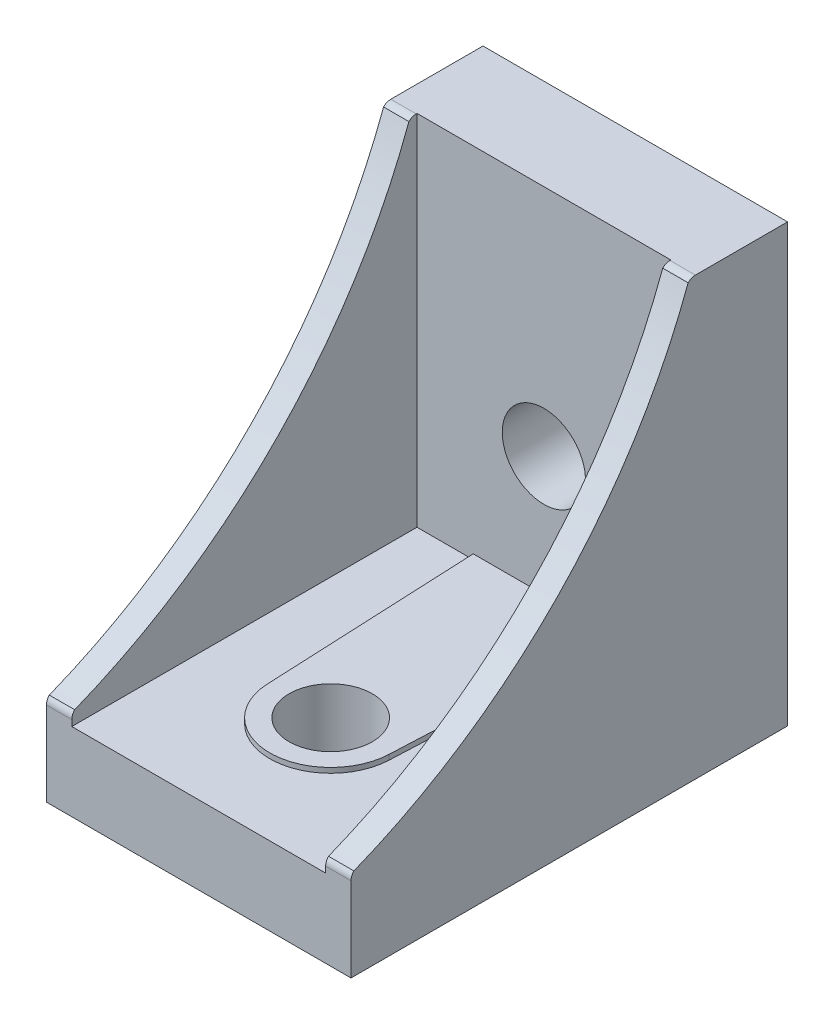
ISO-10303-21;
HEADER;
FILE_DESCRIPTION(('STEP AP214'),'2;1');
FILE_NAME('part.step','',(''),(''),'','','');
FILE_SCHEMA(('AUTOMOTIVE_DESIGN { 1 0 10303 214 1 1 1 1 }'));
ENDSEC;
DATA;
#1=APPLICATION_CONTEXT('core data for automotive mechanical design processes');
#2=APPLICATION_PROTOCOL_DEFINITION('international standard','automotive_design',2000,#1);
#3=PRODUCT_CONTEXT('',#1,'mechanical');
#4=PRODUCT('Part','Part','',(#3));
#5=PRODUCT_RELATED_PRODUCT_CATEGORY('part','',(#4));
#6=PRODUCT_DEFINITION_FORMATION('','',#4);
#7=PRODUCT_DEFINITION_CONTEXT('part definition',#1,'design');
#8=PRODUCT_DEFINITION('design','',#6,#7);
#9=PRODUCT_DEFINITION_SHAPE('','',#8);
#10=(LENGTH_UNIT() NAMED_UNIT(*) SI_UNIT(.MILLI.,.METRE.));
#11=(NAMED_UNIT(*) PLANE_ANGLE_UNIT() SI_UNIT($,.RADIAN.));
#12=(NAMED_UNIT(*) SI_UNIT($,.STERADIAN.) SOLID_ANGLE_UNIT());
#13=UNCERTAINTY_MEASURE_WITH_UNIT(LENGTH_MEASURE(1.E-05),#10,'distance_accuracy_value','');
#14=(GEOMETRIC_REPRESENTATION_CONTEXT(3) GLOBAL_UNCERTAINTY_ASSIGNED_CONTEXT((#13)) GLOBAL_UNIT_ASSIGNED_CONTEXT((#10,
#11,#12)) REPRESENTATION_CONTEXT('',''));
#15=CARTESIAN_POINT('',(0.,0.,0.));
#16=DIRECTION('',(0.,0.,1.));
#17=DIRECTION('',(1.,0.,0.));
#18=AXIS2_PLACEMENT_3D('',#15,#16,#17);
#19=CARTESIAN_POINT('',(-12.5,7.7,52.));
#20=DIRECTION('',(0.,-1.,0.));
#21=DIRECTION('',(0.,0.,-1.));
#22=AXIS2_PLACEMENT_3D('',#19,#20,#21);
#23=PLANE('',#22);
#24=DIRECTION('',(0.0454953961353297,0.,0.998964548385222));
#25=VECTOR('',#24,1.);
#26=CARTESIAN_POINT('',(-5.01979784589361,7.7,51.6593324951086));
#27=LINE('',#26,#25);
#28=CARTESIAN_POINT('',(-6.96261276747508,7.7,9.));
#29=VERTEX_POINT('',#28);
#30=CARTESIAN_POINT('',(-5.99378729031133,7.7,30.272972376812));
#31=VERTEX_POINT('',#30);
#32=EDGE_CURVE('E405',#29,#31,#27,.T.);
#33=ORIENTED_EDGE('',*,*,#32,.F.);
#34=DIRECTION('',(1.,0.,0.));
#35=VECTOR('',#34,1.);
#36=CARTESIAN_POINT('',(-12.5,7.7,9.));
#37=LINE('',#36,#35);
#38=CARTESIAN_POINT('',(-12.5,7.7,9.));
#39=VERTEX_POINT('',#38);
#40=EDGE_CURVE('E426',#39,#29,#37,.T.);
#41=ORIENTED_EDGE('',*,*,#40,.F.);
#42=DIRECTION('',(0.,0.,-1.));
#43=VECTOR('',#42,1.);
#44=CARTESIAN_POINT('',(-12.5,7.7,52.));
#45=LINE('',#44,#43);
#46=CARTESIAN_POINT('',(-12.5,7.7,43.));
#47=VERTEX_POINT('',#46);
#48=EDGE_CURVE('E420',#47,#39,#45,.T.);
#49=ORIENTED_EDGE('',*,*,#48,.F.);
#50=DIRECTION('',(-1.,0.,0.));
#51=VECTOR('',#50,1.);
#52=CARTESIAN_POINT('',(15.,7.7,43.));
#53=LINE('',#52,#51);
#54=CARTESIAN_POINT('',(12.5,7.7,43.));
#55=VERTEX_POINT('',#54);
#56=EDGE_CURVE('E497',#55,#47,#53,.T.);
#57=ORIENTED_EDGE('',*,*,#56,.F.);
#58=DIRECTION('',(0.,0.,-1.));
#59=VECTOR('',#58,1.);
#60=CARTESIAN_POINT('',(12.5,7.7,52.));
#61=LINE('',#60,#59);
#62=CARTESIAN_POINT('',(12.5,7.7,9.));
#63=VERTEX_POINT('',#62);
#64=EDGE_CURVE('E414',#55,#63,#61,.T.);
#65=ORIENTED_EDGE('',*,*,#64,.T.);
#66=CARTESIAN_POINT('',(6.96261276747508,7.7,9.));
#67=VERTEX_POINT('',#66);
#68=EDGE_CURVE('E425',#67,#63,#37,.T.);
#69=ORIENTED_EDGE('',*,*,#68,.F.);
#70=DIRECTION('',(0.0454953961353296,0.,-0.998964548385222));
#71=VECTOR('',#70,1.);
#72=CARTESIAN_POINT('',(4.96805206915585,7.7,52.795539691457));
#73=LINE('',#72,#71);
#74=CARTESIAN_POINT('',(5.99378729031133,7.7,30.272972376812));
#75=VERTEX_POINT('',#74);
#76=EDGE_CURVE('E403',#75,#67,#73,.T.);
#77=ORIENTED_EDGE('',*,*,#76,.F.);
#78=CARTESIAN_POINT('',(0.,7.7,30.));
#79=DIRECTION('',(0.,-1.,0.));
#80=DIRECTION('',(0.,0.,-1.));
#81=AXIS2_PLACEMENT_3D('',#78,#79,#80);
#82=CIRCLE('',#81,6.);
#83=EDGE_CURVE('E11',#31,#75,#82,.F.);
#84=ORIENTED_EDGE('',*,*,#83,.F.);
#85=EDGE_LOOP('',(#33,#41,#49,#57,#65,#69,#77,#84));
#86=FACE_BOUND('',#85,.T.);
#87=ADVANCED_FACE('F16',(#86),#23,.F.);
#88=CARTESIAN_POINT('',(-12.5,7.7,9.));
#89=DIRECTION('',(0.,0.,-1.));
#90=DIRECTION('',(-1.,0.,0.));
#91=AXIS2_PLACEMENT_3D('',#88,#89,#90);
#92=PLANE('',#91);
#93=CARTESIAN_POINT('',(0.,20.,9.));
#94=DIRECTION('',(0.,0.,-1.));
#95=DIRECTION('',(-1.,0.,0.));
#96=AXIS2_PLACEMENT_3D('',#93,#94,#95);
#97=CIRCLE('',#96,4.1);
#98=CARTESIAN_POINT('',(-4.1,20.,9.));
#99=VERTEX_POINT('',#98);
#100=EDGE_CURVE('E388',#99,#99,#97,.F.);
#101=ORIENTED_EDGE('',*,*,#100,.F.);
#102=EDGE_LOOP('',(#101));
#103=FACE_BOUND('',#102,.T.);
#104=DIRECTION('',(0.,-1.,0.));
#105=VECTOR('',#104,1.);
#106=CARTESIAN_POINT('',(-6.96261276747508,7.7,9.));
#107=LINE('',#106,#105);
#108=CARTESIAN_POINT('',(-6.96261276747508,8.2,9.));
#109=VERTEX_POINT('',#108);
#110=EDGE_CURVE('E25',#109,#29,#107,.T.);
#111=ORIENTED_EDGE('',*,*,#110,.F.);
#112=DIRECTION('',(1.,0.,0.));
#113=VECTOR('',#112,1.);
#114=CARTESIAN_POINT('',(-12.5,8.2,9.));
#115=LINE('',#114,#113);
#116=CARTESIAN_POINT('',(6.96261276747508,8.2,9.));
#117=VERTEX_POINT('',#116);
#118=EDGE_CURVE('E503',#109,#117,#115,.T.);
#119=ORIENTED_EDGE('',*,*,#118,.T.);
#120=DIRECTION('',(0.,1.,0.));
#121=VECTOR('',#120,1.);
#122=CARTESIAN_POINT('',(6.96261276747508,7.7,9.));
#123=LINE('',#122,#121);
#124=EDGE_CURVE('E506',#67,#117,#123,.T.);
#125=ORIENTED_EDGE('',*,*,#124,.F.);
#126=ORIENTED_EDGE('',*,*,#68,.T.);
#127=DIRECTION('',(0.,1.,0.));
#128=VECTOR('',#127,1.);
#129=CARTESIAN_POINT('',(12.5,7.7,9.));
#130=LINE('',#129,#128);
#131=CARTESIAN_POINT('',(12.5,43.,9.));
#132=VERTEX_POINT('',#131);
#133=EDGE_CURVE('E417',#63,#132,#130,.T.);
#134=ORIENTED_EDGE('',*,*,#133,.T.);
#135=DIRECTION('',(1.,0.,0.));
#136=VECTOR('',#135,1.);
#137=CARTESIAN_POINT('',(15.,43.,9.));
#138=LINE('',#137,#136);
#139=CARTESIAN_POINT('',(-12.5,43.,9.));
#140=VERTEX_POINT('',#139);
#141=EDGE_CURVE('E494',#140,#132,#138,.T.);
#142=ORIENTED_EDGE('',*,*,#141,.F.);
#143=DIRECTION('',(0.,1.,0.));
#144=VECTOR('',#143,1.);
#145=CARTESIAN_POINT('',(-12.5,7.7,9.));
#146=LINE('',#145,#144);
#147=EDGE_CURVE('E422',#39,#140,#146,.T.);
#148=ORIENTED_EDGE('',*,*,#147,.F.);
#149=ORIENTED_EDGE('',*,*,#40,.T.);
#150=EDGE_LOOP('',(#111,#119,#125,#126,#134,#142,#148,#149));
#151=FACE_BOUND('',#150,.T.);
#152=ADVANCED_FACE('F522',(#103,#151),#92,.F.);
#153=CARTESIAN_POINT('',(15.,8.29268128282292,43.));
#154=DIRECTION('',(0.,0.,-1.));
#155=DIRECTION('',(-1.,0.,0.));
#156=AXIS2_PLACEMENT_3D('',#153,#154,#155);
#157=PLANE('',#156);
#158=DIRECTION('',(0.,-1.,0.));
#159=VECTOR('',#158,1.);
#160=CARTESIAN_POINT('',(-15.,8.29268128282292,43.));
#161=LINE('',#160,#159);
#162=CARTESIAN_POINT('',(-15.,8.29268128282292,43.));
#163=VERTEX_POINT('',#162);
#164=CARTESIAN_POINT('',(-15.,0.,43.));
#165=VERTEX_POINT('',#164);
#166=EDGE_CURVE('E445',#163,#165,#161,.T.);
#167=ORIENTED_EDGE('',*,*,#166,.T.);
#168=DIRECTION('',(1.,0.,0.));
#169=VECTOR('',#168,1.);
#170=CARTESIAN_POINT('',(-15.,0.,43.));
#171=LINE('',#170,#169);
#172=CARTESIAN_POINT('',(15.,0.,43.));
#173=VERTEX_POINT('',#172);
#174=EDGE_CURVE('E32',#165,#173,#171,.T.);
#175=ORIENTED_EDGE('',*,*,#174,.T.);
#176=DIRECTION('',(0.,-1.,0.));
#177=VECTOR('',#176,1.);
#178=CARTESIAN_POINT('',(15.,8.29268128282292,43.));
#179=LINE('',#178,#177);
#180=CARTESIAN_POINT('',(15.,8.29268128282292,43.));
#181=VERTEX_POINT('',#180);
#182=EDGE_CURVE('E459',#181,#173,#179,.T.);
#183=ORIENTED_EDGE('',*,*,#182,.F.);
#184=DIRECTION('',(-1.,0.,0.));
#185=VECTOR('',#184,1.);
#186=CARTESIAN_POINT('',(15.,8.29268128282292,43.));
#187=LINE('',#186,#185);
#188=CARTESIAN_POINT('',(12.5,8.29268128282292,43.));
#189=VERTEX_POINT('',#188);
#190=EDGE_CURVE('E472',#181,#189,#187,.T.);
#191=ORIENTED_EDGE('',*,*,#190,.T.);
#192=DIRECTION('',(0.,-1.,0.));
#193=VECTOR('',#192,1.);
#194=CARTESIAN_POINT('',(12.5,8.29268128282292,43.));
#195=LINE('',#194,#193);
#196=EDGE_CURVE('E435',#189,#55,#195,.T.);
#197=ORIENTED_EDGE('',*,*,#196,.T.);
#198=ORIENTED_EDGE('',*,*,#56,.T.);
#199=DIRECTION('',(0.,-1.,0.));
#200=VECTOR('',#199,1.);
#201=CARTESIAN_POINT('',(-12.5,8.29268128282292,43.));
#202=LINE('',#201,#200);
#203=CARTESIAN_POINT('',(-12.5,8.29268128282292,43.));
#204=VERTEX_POINT('',#203);
#205=EDGE_CURVE('E443',#204,#47,#202,.T.);
#206=ORIENTED_EDGE('',*,*,#205,.F.);
#207=EDGE_CURVE('E471',#204,#163,#187,.T.);
#208=ORIENTED_EDGE('',*,*,#207,.T.);
#209=EDGE_LOOP('',(#167,#175,#183,#191,#197,#198,#206,#208));
#210=FACE_BOUND('',#209,.T.);
#211=ADVANCED_FACE('F18',(#210),#157,.F.);
#212=CARTESIAN_POINT('',(15.,43.,0.));
#213=DIRECTION('',(0.,-1.,0.));
#214=DIRECTION('',(0.,0.,-1.));
#215=AXIS2_PLACEMENT_3D('',#212,#213,#214);
#216=PLANE('',#215);
#217=DIRECTION('',(0.,0.,1.));
#218=VECTOR('',#217,1.);
#219=CARTESIAN_POINT('',(-12.5,43.,0.));
#220=LINE('',#219,#218);
#221=CARTESIAN_POINT('',(-12.5,43.,9.07885781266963));
#222=VERTEX_POINT('',#221);
#223=EDGE_CURVE('E441',#140,#222,#220,.T.);
#224=ORIENTED_EDGE('',*,*,#223,.F.);
#225=ORIENTED_EDGE('',*,*,#141,.T.);
#226=DIRECTION('',(0.,0.,1.));
#227=VECTOR('',#226,1.);
#228=CARTESIAN_POINT('',(12.5,43.,0.));
#229=LINE('',#228,#227);
#230=CARTESIAN_POINT('',(12.5,43.,9.07885781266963));
#231=VERTEX_POINT('',#230);
#232=EDGE_CURVE('E432',#132,#231,#229,.T.);
#233=ORIENTED_EDGE('',*,*,#232,.T.);
#234=DIRECTION('',(-1.,0.,0.));
#235=VECTOR('',#234,1.);
#236=CARTESIAN_POINT('',(15.,43.,9.07885781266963));
#237=LINE('',#236,#235);
#238=CARTESIAN_POINT('',(15.,43.,9.07885781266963));
#239=VERTEX_POINT('',#238);
#240=EDGE_CURVE('E483',#239,#231,#237,.T.);
#241=ORIENTED_EDGE('',*,*,#240,.F.);
#242=DIRECTION('',(0.,0.,1.));
#243=VECTOR('',#242,1.);
#244=CARTESIAN_POINT('',(15.,43.,0.));
#245=LINE('',#244,#243);
#246=CARTESIAN_POINT('',(15.,43.,0.));
#247=VERTEX_POINT('',#246);
#248=EDGE_CURVE('E464',#247,#239,#245,.T.);
#249=ORIENTED_EDGE('',*,*,#248,.F.);
#250=DIRECTION('',(-1.,0.,0.));
#251=VECTOR('',#250,1.);
#252=CARTESIAN_POINT('',(15.,43.,0.));
#253=LINE('',#252,#251);
#254=CARTESIAN_POINT('',(-15.,43.,0.));
#255=VERTEX_POINT('',#254);
#256=EDGE_CURVE('E486',#247,#255,#253,.T.);
#257=ORIENTED_EDGE('',*,*,#256,.T.);
#258=DIRECTION('',(0.,0.,1.));
#259=VECTOR('',#258,1.);
#260=CARTESIAN_POINT('',(-15.,43.,0.));
#261=LINE('',#260,#259);
#262=CARTESIAN_POINT('',(-15.,43.,9.07885781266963));
#263=VERTEX_POINT('',#262);
#264=EDGE_CURVE('E450',#255,#263,#261,.T.);
#265=ORIENTED_EDGE('',*,*,#264,.T.);
#266=EDGE_CURVE('E482',#222,#263,#237,.T.);
#267=ORIENTED_EDGE('',*,*,#266,.F.);
#268=EDGE_LOOP('',(#224,#225,#233,#241,#249,#257,#265,#267));
#269=FACE_BOUND('',#268,.T.);
#270=ADVANCED_FACE('F530',(#269),#216,.F.);
#271=CARTESIAN_POINT('',(15.,42.,9.07885781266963));
#272=DIRECTION('',(-1.,0.,0.));
#273=DIRECTION('',(0.,0.,1.));
#274=AXIS2_PLACEMENT_3D('',#271,#272,#273);
#275=CYLINDRICAL_SURFACE('',#274,0.99999999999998);
#276=CARTESIAN_POINT('',(-12.5,42.,9.07885781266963));
#277=DIRECTION('',(1.,0.,0.));
#278=DIRECTION('',(0.,0.,-1.));
#279=AXIS2_PLACEMENT_3D('',#276,#277,#278);
#280=CIRCLE('',#279,0.99999999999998);
#281=CARTESIAN_POINT('',(-12.5,42.6987147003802,9.79425823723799));
#282=VERTEX_POINT('',#281);
#283=EDGE_CURVE('E438',#222,#282,#280,.T.);
#284=ORIENTED_EDGE('',*,*,#283,.F.);
#285=ORIENTED_EDGE('',*,*,#266,.T.);
#286=CARTESIAN_POINT('',(-15.,42.,9.07885781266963));
#287=DIRECTION('',(1.,0.,0.));
#288=DIRECTION('',(0.,0.,-1.));
#289=AXIS2_PLACEMENT_3D('',#286,#287,#288);
#290=CIRCLE('',#289,0.99999999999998);
#291=CARTESIAN_POINT('',(-15.,42.6987147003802,9.79425823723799));
#292=VERTEX_POINT('',#291);
#293=EDGE_CURVE('E453',#263,#292,#290,.T.);
#294=ORIENTED_EDGE('',*,*,#293,.T.);
#295=DIRECTION('',(-1.,0.,0.));
#296=VECTOR('',#295,1.);
#297=CARTESIAN_POINT('',(15.,42.6987147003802,9.794258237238));
#298=LINE('',#297,#296);
#299=EDGE_CURVE('E479',#282,#292,#298,.T.);
#300=ORIENTED_EDGE('',*,*,#299,.F.);
#301=EDGE_LOOP('',(#284,#285,#294,#300));
#302=FACE_BOUND('',#301,.T.);
#303=ADVANCED_FACE('F534',(#302),#275,.T.);
#304=CARTESIAN_POINT('',(15.,8.29268128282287,42.));
#305=DIRECTION('',(-1.,0.,0.));
#306=DIRECTION('',(0.,0.,1.));
#307=AXIS2_PLACEMENT_3D('',#304,#305,#306);
#308=CYLINDRICAL_SURFACE('',#307,1.00000000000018);
#309=CARTESIAN_POINT('',(-12.5,8.29268128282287,42.));
#310=DIRECTION('',(1.,0.,0.));
#311=DIRECTION('',(0.,0.,-1.));
#312=AXIS2_PLACEMENT_3D('',#309,#310,#311);
#313=CIRCLE('',#312,1.00000000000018);
#314=CARTESIAN_POINT('',(-12.5,8.99139598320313,42.7154004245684));
#315=VERTEX_POINT('',#314);
#316=EDGE_CURVE('E492',#315,#204,#313,.T.);
#317=ORIENTED_EDGE('',*,*,#316,.F.);
#318=DIRECTION('',(-1.,0.,0.));
#319=VECTOR('',#318,1.);
#320=CARTESIAN_POINT('',(15.,8.99139598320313,42.7154004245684));
#321=LINE('',#320,#319);
#322=CARTESIAN_POINT('',(-15.,8.99139598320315,42.7154004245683));
#323=VERTEX_POINT('',#322);
#324=EDGE_CURVE('E475',#315,#323,#321,.T.);
#325=ORIENTED_EDGE('',*,*,#324,.T.);
#326=CARTESIAN_POINT('',(-15.,8.29268128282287,42.));
#327=DIRECTION('',(1.,0.,0.));
#328=DIRECTION('',(0.,0.,-1.));
#329=AXIS2_PLACEMENT_3D('',#326,#327,#328);
#330=CIRCLE('',#329,1.00000000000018);
#331=EDGE_CURVE('E456',#323,#163,#330,.T.);
#332=ORIENTED_EDGE('',*,*,#331,.T.);
#333=ORIENTED_EDGE('',*,*,#207,.F.);
#334=EDGE_LOOP('',(#317,#325,#332,#333));
#335=FACE_BOUND('',#334,.T.);
#336=ADVANCED_FACE('F546',(#335),#308,.T.);
#337=CARTESIAN_POINT('',(15.,0.,0.));
#338=DIRECTION('',(0.,0.,1.));
#339=DIRECTION('',(1.,0.,0.));
#340=AXIS2_PLACEMENT_3D('',#337,#338,#339);
#341=PLANE('',#340);
#342=CARTESIAN_POINT('',(0.,20.,0.));
#343=DIRECTION('',(0.,0.,1.));
#344=DIRECTION('',(1.,0.,0.));
#345=AXIS2_PLACEMENT_3D('',#342,#343,#344);
#346=CIRCLE('',#345,4.1);
#347=CARTESIAN_POINT('',(4.1,20.,0.));
#348=VERTEX_POINT('',#347);
#349=EDGE_CURVE('E20',#348,#348,#346,.F.);
#350=ORIENTED_EDGE('',*,*,#349,.F.);
#351=EDGE_LOOP('',(#350));
#352=FACE_BOUND('',#351,.T.);
#353=DIRECTION('',(0.,1.,0.));
#354=VECTOR('',#353,1.);
#355=CARTESIAN_POINT('',(15.,0.,0.));
#356=LINE('',#355,#354);
#357=CARTESIAN_POINT('',(15.,0.,0.));
#358=VERTEX_POINT('',#357);
#359=EDGE_CURVE('E462',#358,#247,#356,.T.);
#360=ORIENTED_EDGE('',*,*,#359,.F.);
#361=DIRECTION('',(-1.,0.,0.));
#362=VECTOR('',#361,1.);
#363=CARTESIAN_POINT('',(15.,0.,0.));
#364=LINE('',#363,#362);
#365=CARTESIAN_POINT('',(-15.,0.,0.));
#366=VERTEX_POINT('',#365);
#367=EDGE_CURVE('E360',#358,#366,#364,.T.);
#368=ORIENTED_EDGE('',*,*,#367,.T.);
#369=DIRECTION('',(0.,1.,0.));
#370=VECTOR('',#369,1.);
#371=CARTESIAN_POINT('',(-15.,0.,0.));
#372=LINE('',#371,#370);
#373=EDGE_CURVE('E448',#366,#255,#372,.T.);
#374=ORIENTED_EDGE('',*,*,#373,.T.);
#375=ORIENTED_EDGE('',*,*,#256,.F.);
#376=EDGE_LOOP('',(#360,#368,#374,#375));
#377=FACE_BOUND('',#376,.T.);
#378=ADVANCED_FACE('F604',(#352,#377),#341,.F.);
#379=ORIENTED_EDGE('',*,*,#240,.T.);
#380=CARTESIAN_POINT('',(12.5,42.,9.07885781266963));
#381=DIRECTION('',(1.,0.,0.));
#382=DIRECTION('',(0.,0.,-1.));
#383=AXIS2_PLACEMENT_3D('',#380,#381,#382);
#384=CIRCLE('',#383,0.99999999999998);
#385=CARTESIAN_POINT('',(12.5,42.6987147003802,9.794258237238));
#386=VERTEX_POINT('',#385);
#387=EDGE_CURVE('E429',#231,#386,#384,.T.);
#388=ORIENTED_EDGE('',*,*,#387,.T.);
#389=CARTESIAN_POINT('',(15.,42.6987147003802,9.79425823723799));
#390=VERTEX_POINT('',#389);
#391=EDGE_CURVE('E480',#390,#386,#298,.T.);
#392=ORIENTED_EDGE('',*,*,#391,.F.);
#393=CARTESIAN_POINT('',(15.,42.,9.07885781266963));
#394=DIRECTION('',(1.,0.,0.));
#395=DIRECTION('',(0.,0.,-1.));
#396=AXIS2_PLACEMENT_3D('',#393,#394,#395);
#397=CIRCLE('',#396,0.99999999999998);
#398=EDGE_CURVE('E466',#239,#390,#397,.T.);
#399=ORIENTED_EDGE('',*,*,#398,.F.);
#400=EDGE_LOOP('',(#379,#388,#392,#399));
#401=FACE_BOUND('',#400,.T.);
#402=ADVANCED_FACE('F600',(#401),#275,.T.);
#403=CARTESIAN_POINT('',(15.,8.99139598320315,42.7154004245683));
#404=VERTEX_POINT('',#403);
#405=CARTESIAN_POINT('',(12.5,8.99139598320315,42.7154004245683));
#406=VERTEX_POINT('',#405);
#407=EDGE_CURVE('E476',#404,#406,#321,.T.);
#408=ORIENTED_EDGE('',*,*,#407,.T.);
#409=CARTESIAN_POINT('',(12.5,8.29268128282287,42.));
#410=DIRECTION('',(1.,0.,0.));
#411=DIRECTION('',(0.,0.,-1.));
#412=AXIS2_PLACEMENT_3D('',#409,#410,#411);
#413=CIRCLE('',#412,1.00000000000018);
#414=EDGE_CURVE('E489',#406,#189,#413,.T.);
#415=ORIENTED_EDGE('',*,*,#414,.T.);
#416=ORIENTED_EDGE('',*,*,#190,.F.);
#417=CARTESIAN_POINT('',(15.,8.29268128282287,42.));
#418=DIRECTION('',(1.,0.,0.));
#419=DIRECTION('',(0.,0.,-1.));
#420=AXIS2_PLACEMENT_3D('',#417,#418,#419);
#421=CIRCLE('',#420,1.00000000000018);
#422=EDGE_CURVE('E469',#404,#181,#421,.T.);
#423=ORIENTED_EDGE('',*,*,#422,.F.);
#424=EDGE_LOOP('',(#408,#415,#416,#423));
#425=FACE_BOUND('',#424,.T.);
#426=ADVANCED_FACE('F596',(#425),#308,.T.);
#427=CARTESIAN_POINT('',(15.,42.,9.07885781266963));
#428=DIRECTION('',(1.,0.,0.));
#429=DIRECTION('',(0.,0.,-1.));
#430=AXIS2_PLACEMENT_3D('',#427,#428,#429);
#431=PLANE('',#430);
#432=DIRECTION('',(0.,0.,-1.));
#433=VECTOR('',#432,1.);
#434=CARTESIAN_POINT('',(15.,0.,43.));
#435=LINE('',#434,#433);
#436=EDGE_CURVE('E379',#173,#358,#435,.T.);
#437=ORIENTED_EDGE('',*,*,#436,.T.);
#438=ORIENTED_EDGE('',*,*,#359,.T.);
#439=ORIENTED_EDGE('',*,*,#248,.T.);
#440=ORIENTED_EDGE('',*,*,#398,.T.);
#441=CARTESIAN_POINT('',(15.,62.8766713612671,64.1707824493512));
#442=DIRECTION('',(1.,0.,0.));
#443=DIRECTION('',(0.,0.,-1.));
#444=AXIS2_PLACEMENT_3D('',#441,#442,#443);
#445=CIRCLE('',#444,57.9996234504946);
#446=EDGE_CURVE('E407',#404,#390,#445,.T.);
#447=ORIENTED_EDGE('',*,*,#446,.F.);
#448=ORIENTED_EDGE('',*,*,#422,.T.);
#449=ORIENTED_EDGE('',*,*,#182,.T.);
#450=EDGE_LOOP('',(#437,#438,#439,#440,#447,#448,#449));
#451=FACE_BOUND('',#450,.T.);
#452=ADVANCED_FACE('F593',(#451),#431,.T.);
#453=CARTESIAN_POINT('',(-15.,42.,9.07885781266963));
#454=DIRECTION('',(1.,0.,0.));
#455=DIRECTION('',(0.,0.,-1.));
#456=AXIS2_PLACEMENT_3D('',#453,#454,#455);
#457=PLANE('',#456);
#458=ORIENTED_EDGE('',*,*,#373,.F.);
#459=DIRECTION('',(0.,0.,1.));
#460=VECTOR('',#459,1.);
#461=CARTESIAN_POINT('',(-15.,0.,0.));
#462=LINE('',#461,#460);
#463=EDGE_CURVE('E376',#366,#165,#462,.T.);
#464=ORIENTED_EDGE('',*,*,#463,.T.);
#465=ORIENTED_EDGE('',*,*,#166,.F.);
#466=ORIENTED_EDGE('',*,*,#331,.F.);
#467=CARTESIAN_POINT('',(-15.,62.8766713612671,64.1707824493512));
#468=DIRECTION('',(1.,0.,0.));
#469=DIRECTION('',(0.,0.,-1.));
#470=AXIS2_PLACEMENT_3D('',#467,#468,#469);
#471=CIRCLE('',#470,57.9996234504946);
#472=EDGE_CURVE('E409',#323,#292,#471,.T.);
#473=ORIENTED_EDGE('',*,*,#472,.T.);
#474=ORIENTED_EDGE('',*,*,#293,.F.);
#475=ORIENTED_EDGE('',*,*,#264,.F.);
#476=EDGE_LOOP('',(#458,#464,#465,#466,#473,#474,#475));
#477=FACE_BOUND('',#476,.T.);
#478=ADVANCED_FACE('F538',(#477),#457,.F.);
#479=CARTESIAN_POINT('',(-12.5,0.,0.));
#480=DIRECTION('',(1.,0.,0.));
#481=DIRECTION('',(0.,0.,-1.));
#482=AXIS2_PLACEMENT_3D('',#479,#480,#481);
#483=PLANE('',#482);
#484=CARTESIAN_POINT('',(-12.5,62.8766713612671,64.1707824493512));
#485=DIRECTION('',(1.,0.,0.));
#486=DIRECTION('',(0.,0.,-1.));
#487=AXIS2_PLACEMENT_3D('',#484,#485,#486);
#488=CIRCLE('',#487,57.9996234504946);
#489=EDGE_CURVE('E412',#315,#282,#488,.T.);
#490=ORIENTED_EDGE('',*,*,#489,.F.);
#491=ORIENTED_EDGE('',*,*,#316,.T.);
#492=ORIENTED_EDGE('',*,*,#205,.T.);
#493=ORIENTED_EDGE('',*,*,#48,.T.);
#494=ORIENTED_EDGE('',*,*,#147,.T.);
#495=ORIENTED_EDGE('',*,*,#223,.T.);
#496=ORIENTED_EDGE('',*,*,#283,.T.);
#497=EDGE_LOOP('',(#490,#491,#492,#493,#494,#495,#496));
#498=FACE_BOUND('',#497,.T.);
#499=ADVANCED_FACE('F526',(#498),#483,.T.);
#500=CARTESIAN_POINT('',(12.5,0.,0.));
#501=DIRECTION('',(1.,0.,0.));
#502=DIRECTION('',(0.,0.,-1.));
#503=AXIS2_PLACEMENT_3D('',#500,#501,#502);
#504=PLANE('',#503);
#505=ORIENTED_EDGE('',*,*,#414,.F.);
#506=CARTESIAN_POINT('',(12.5,62.8766713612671,64.1707824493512));
#507=DIRECTION('',(1.,0.,0.));
#508=DIRECTION('',(0.,0.,-1.));
#509=AXIS2_PLACEMENT_3D('',#506,#507,#508);
#510=CIRCLE('',#509,57.9996234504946);
#511=EDGE_CURVE('E500',#406,#386,#510,.T.);
#512=ORIENTED_EDGE('',*,*,#511,.T.);
#513=ORIENTED_EDGE('',*,*,#387,.F.);
#514=ORIENTED_EDGE('',*,*,#232,.F.);
#515=ORIENTED_EDGE('',*,*,#133,.F.);
#516=ORIENTED_EDGE('',*,*,#64,.F.);
#517=ORIENTED_EDGE('',*,*,#196,.F.);
#518=EDGE_LOOP('',(#505,#512,#513,#514,#515,#516,#517));
#519=FACE_BOUND('',#518,.T.);
#520=ADVANCED_FACE('F555',(#519),#504,.F.);
#521=CARTESIAN_POINT('',(-15.,62.8766713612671,64.1707824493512));
#522=DIRECTION('',(1.,0.,0.));
#523=DIRECTION('',(0.,0.,-1.));
#524=AXIS2_PLACEMENT_3D('',#521,#522,#523);
#525=CYLINDRICAL_SURFACE('',#524,57.9996234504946);
#526=ORIENTED_EDGE('',*,*,#407,.F.);
#527=ORIENTED_EDGE('',*,*,#446,.T.);
#528=ORIENTED_EDGE('',*,*,#391,.T.);
#529=ORIENTED_EDGE('',*,*,#511,.F.);
#530=EDGE_LOOP('',(#526,#527,#528,#529));
#531=FACE_BOUND('',#530,.T.);
#532=ADVANCED_FACE('F628',(#531),#525,.F.);
#533=ORIENTED_EDGE('',*,*,#489,.T.);
#534=ORIENTED_EDGE('',*,*,#299,.T.);
#535=ORIENTED_EDGE('',*,*,#472,.F.);
#536=ORIENTED_EDGE('',*,*,#324,.F.);
#537=EDGE_LOOP('',(#533,#534,#535,#536));
#538=FACE_BOUND('',#537,.T.);
#539=ADVANCED_FACE('F543',(#538),#525,.F.);
#540=CARTESIAN_POINT('',(0.,8.2,30.));
#541=DIRECTION('',(0.,-1.,0.));
#542=DIRECTION('',(0.,0.,-1.));
#543=AXIS2_PLACEMENT_3D('',#540,#541,#542);
#544=CYLINDRICAL_SURFACE('',#543,6.);
#545=DIRECTION('',(0.,-1.,0.));
#546=VECTOR('',#545,1.);
#547=CARTESIAN_POINT('',(-5.99378729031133,8.2,30.272972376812));
#548=LINE('',#547,#546);
#549=CARTESIAN_POINT('',(-5.99378729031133,8.2,30.272972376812));
#550=VERTEX_POINT('',#549);
#551=EDGE_CURVE('E400',#550,#31,#548,.T.);
#552=ORIENTED_EDGE('',*,*,#551,.T.);
#553=ORIENTED_EDGE('',*,*,#83,.T.);
#554=DIRECTION('',(0.,-1.,0.));
#555=VECTOR('',#554,1.);
#556=CARTESIAN_POINT('',(5.99378729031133,8.2,30.272972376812));
#557=LINE('',#556,#555);
#558=CARTESIAN_POINT('',(5.99378729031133,8.2,30.272972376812));
#559=VERTEX_POINT('',#558);
#560=EDGE_CURVE('E397',#559,#75,#557,.T.);
#561=ORIENTED_EDGE('',*,*,#560,.F.);
#562=CARTESIAN_POINT('',(0.,8.2,30.));
#563=DIRECTION('',(0.,1.,0.));
#564=DIRECTION('',(0.,0.,1.));
#565=AXIS2_PLACEMENT_3D('',#562,#563,#564);
#566=CIRCLE('',#565,6.);
#567=EDGE_CURVE('E393',#550,#559,#566,.T.);
#568=ORIENTED_EDGE('',*,*,#567,.F.);
#569=EDGE_LOOP('',(#552,#553,#561,#568));
#570=FACE_BOUND('',#569,.T.);
#571=ADVANCED_FACE('F563',(#570),#544,.T.);
#572=CARTESIAN_POINT('',(-7.12201170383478,8.2,5.5));
#573=DIRECTION('',(0.998964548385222,0.,-0.0454953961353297));
#574=DIRECTION('',(-0.0454953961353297,0.,-0.998964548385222));
#575=AXIS2_PLACEMENT_3D('',#572,#573,#574);
#576=PLANE('',#575);
#577=ORIENTED_EDGE('',*,*,#110,.T.);
#578=ORIENTED_EDGE('',*,*,#32,.T.);
#579=ORIENTED_EDGE('',*,*,#551,.F.);
#580=DIRECTION('',(0.0454953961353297,0.,0.998964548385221));
#581=VECTOR('',#580,1.);
#582=CARTESIAN_POINT('',(-7.12201170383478,8.2,5.5));
#583=LINE('',#582,#581);
#584=EDGE_CURVE('E391',#109,#550,#583,.T.);
#585=ORIENTED_EDGE('',*,*,#584,.F.);
#586=EDGE_LOOP('',(#577,#578,#579,#585));
#587=FACE_BOUND('',#586,.T.);
#588=ADVANCED_FACE('F513',(#587),#576,.F.);
#589=CARTESIAN_POINT('',(5.99378729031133,8.2,30.272972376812));
#590=DIRECTION('',(-0.998964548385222,0.,-0.0454953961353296));
#591=DIRECTION('',(-0.0454953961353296,0.,0.998964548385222));
#592=AXIS2_PLACEMENT_3D('',#589,#590,#591);
#593=PLANE('',#592);
#594=ORIENTED_EDGE('',*,*,#560,.T.);
#595=ORIENTED_EDGE('',*,*,#76,.T.);
#596=ORIENTED_EDGE('',*,*,#124,.T.);
#597=DIRECTION('',(0.0454953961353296,0.,-0.998964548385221));
#598=VECTOR('',#597,1.);
#599=CARTESIAN_POINT('',(5.99378729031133,8.2,30.272972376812));
#600=LINE('',#599,#598);
#601=EDGE_CURVE('E395',#559,#117,#600,.T.);
#602=ORIENTED_EDGE('',*,*,#601,.F.);
#603=EDGE_LOOP('',(#594,#595,#596,#602));
#604=FACE_BOUND('',#603,.T.);
#605=ADVANCED_FACE('F558',(#604),#593,.F.);
#606=CARTESIAN_POINT('',(0.,8.2,30.));
#607=DIRECTION('',(0.,1.,0.));
#608=DIRECTION('',(0.,0.,1.));
#609=AXIS2_PLACEMENT_3D('',#606,#607,#608);
#610=PLANE('',#609);
#611=CARTESIAN_POINT('',(0.,8.2,30.));
#612=DIRECTION('',(0.,1.,0.));
#613=DIRECTION('',(0.,0.,1.));
#614=AXIS2_PLACEMENT_3D('',#611,#612,#613);
#615=CIRCLE('',#614,4.1);
#616=CARTESIAN_POINT('',(0.,8.2,34.1));
#617=VERTEX_POINT('',#616);
#618=EDGE_CURVE('E385',#617,#617,#615,.T.);
#619=ORIENTED_EDGE('',*,*,#618,.F.);
#620=EDGE_LOOP('',(#619));
#621=FACE_BOUND('',#620,.T.);
#622=ORIENTED_EDGE('',*,*,#118,.F.);
#623=ORIENTED_EDGE('',*,*,#584,.T.);
#624=ORIENTED_EDGE('',*,*,#567,.T.);
#625=ORIENTED_EDGE('',*,*,#601,.T.);
#626=EDGE_LOOP('',(#622,#623,#624,#625));
#627=FACE_BOUND('',#626,.T.);
#628=ADVANCED_FACE('F565',(#621,#627),#610,.T.);
#629=CARTESIAN_POINT('',(0.,20.,9.5));
#630=DIRECTION('',(0.,0.,-1.));
#631=DIRECTION('',(-1.,0.,0.));
#632=AXIS2_PLACEMENT_3D('',#629,#630,#631);
#633=CYLINDRICAL_SURFACE('',#632,4.1);
#634=ORIENTED_EDGE('',*,*,#349,.T.);
#635=EDGE_LOOP('',(#634));
#636=FACE_BOUND('',#635,.T.);
#637=ORIENTED_EDGE('',*,*,#100,.T.);
#638=EDGE_LOOP('',(#637));
#639=FACE_BOUND('',#638,.T.);
#640=ADVANCED_FACE('F567',(#636,#639),#633,.F.);
#641=CARTESIAN_POINT('',(0.,8.2,30.));
#642=DIRECTION('',(0.,-1.,0.));
#643=DIRECTION('',(0.,0.,-1.));
#644=AXIS2_PLACEMENT_3D('',#641,#642,#643);
#645=CYLINDRICAL_SURFACE('',#644,4.1);
#646=ORIENTED_EDGE('',*,*,#618,.T.);
#647=EDGE_LOOP('',(#646));
#648=FACE_BOUND('',#647,.T.);
#649=CARTESIAN_POINT('',(0.,0.,30.));
#650=DIRECTION('',(0.,1.,0.));
#651=DIRECTION('',(0.,0.,1.));
#652=AXIS2_PLACEMENT_3D('',#649,#650,#651);
#653=CIRCLE('',#652,4.1);
#654=CARTESIAN_POINT('',(0.,0.,34.1));
#655=VERTEX_POINT('',#654);
#656=EDGE_CURVE('E382',#655,#655,#653,.T.);
#657=ORIENTED_EDGE('',*,*,#656,.F.);
#658=EDGE_LOOP('',(#657));
#659=FACE_BOUND('',#658,.T.);
#660=ADVANCED_FACE('F576',(#648,#659),#645,.F.);
#661=CARTESIAN_POINT('',(0.,0.,0.));
#662=DIRECTION('',(0.,1.,0.));
#663=DIRECTION('',(0.,0.,1.));
#664=AXIS2_PLACEMENT_3D('',#661,#662,#663);
#665=PLANE('',#664);
#666=ORIENTED_EDGE('',*,*,#656,.T.);
#667=EDGE_LOOP('',(#666));
#668=FACE_BOUND('',#667,.T.);
#669=CARTESIAN_POINT('',(-4.7,0.,37.7));
#670=DIRECTION('',(0.,1.,0.));
#671=DIRECTION('',(0.,0.,1.));
#672=AXIS2_PLACEMENT_3D('',#669,#670,#671);
#673=CIRCLE('',#672,0.299999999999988);
#674=CARTESIAN_POINT('',(-5.,0.,37.7));
#675=VERTEX_POINT('',#674);
#676=CARTESIAN_POINT('',(-4.7,0.,38.));
#677=VERTEX_POINT('',#676);
#678=EDGE_CURVE('E279',#675,#677,#673,.T.);
#679=ORIENTED_EDGE('',*,*,#678,.T.);
#680=DIRECTION('',(1.,0.,0.));
#681=VECTOR('',#680,1.);
#682=CARTESIAN_POINT('',(-4.7,0.,38.));
#683=LINE('',#682,#681);
#684=CARTESIAN_POINT('',(4.7,0.,38.));
#685=VERTEX_POINT('',#684);
#686=EDGE_CURVE('E281',#677,#685,#683,.T.);
#687=ORIENTED_EDGE('',*,*,#686,.T.);
#688=CARTESIAN_POINT('',(4.7,0.,37.7));
#689=DIRECTION('',(0.,1.,0.));
#690=DIRECTION('',(0.,0.,1.));
#691=AXIS2_PLACEMENT_3D('',#688,#689,#690);
#692=CIRCLE('',#691,0.299999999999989);
#693=CARTESIAN_POINT('',(5.,0.,37.7));
#694=VERTEX_POINT('',#693);
#695=EDGE_CURVE('E284',#685,#694,#692,.T.);
#696=ORIENTED_EDGE('',*,*,#695,.T.);
#697=DIRECTION('',(0.,0.,-1.));
#698=VECTOR('',#697,1.);
#699=CARTESIAN_POINT('',(5.,0.,37.7));
#700=LINE('',#699,#698);
#701=CARTESIAN_POINT('',(5.,0.,35.3));
#702=VERTEX_POINT('',#701);
#703=EDGE_CURVE('E245',#694,#702,#700,.T.);
#704=ORIENTED_EDGE('',*,*,#703,.T.);
#705=CARTESIAN_POINT('',(4.7,0.,35.3));
#706=DIRECTION('',(0.,1.,0.));
#707=DIRECTION('',(0.,0.,1.));
#708=AXIS2_PLACEMENT_3D('',#705,#706,#707);
#709=CIRCLE('',#708,0.299999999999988);
#710=CARTESIAN_POINT('',(4.7,0.,35.));
#711=VERTEX_POINT('',#710);
#712=EDGE_CURVE('E287',#702,#711,#709,.T.);
#713=ORIENTED_EDGE('',*,*,#712,.T.);
#714=DIRECTION('',(-1.,0.,0.));
#715=VECTOR('',#714,1.);
#716=CARTESIAN_POINT('',(4.7,0.,35.));
#717=LINE('',#716,#715);
#718=CARTESIAN_POINT('',(-4.7,0.,35.));
#719=VERTEX_POINT('',#718);
#720=EDGE_CURVE('E290',#711,#719,#717,.T.);
#721=ORIENTED_EDGE('',*,*,#720,.T.);
#722=CARTESIAN_POINT('',(-4.7,0.,35.3));
#723=DIRECTION('',(0.,1.,0.));
#724=DIRECTION('',(0.,0.,1.));
#725=AXIS2_PLACEMENT_3D('',#722,#723,#724);
#726=CIRCLE('',#725,0.299999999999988);
#727=CARTESIAN_POINT('',(-5.,0.,35.3));
#728=VERTEX_POINT('',#727);
#729=EDGE_CURVE('E293',#719,#728,#726,.T.);
#730=ORIENTED_EDGE('',*,*,#729,.T.);
#731=DIRECTION('',(0.,0.,1.));
#732=VECTOR('',#731,1.);
#733=CARTESIAN_POINT('',(-5.,0.,35.3));
#734=LINE('',#733,#732);
#735=EDGE_CURVE('E296',#728,#675,#734,.T.);
#736=ORIENTED_EDGE('',*,*,#735,.T.);
#737=EDGE_LOOP('',(#679,#687,#696,#704,#713,#721,#730,#736));
#738=FACE_BOUND('',#737,.T.);
#739=CARTESIAN_POINT('',(-4.7,0.,12.7));
#740=DIRECTION('',(0.,1.,0.));
#741=DIRECTION('',(0.,0.,1.));
#742=AXIS2_PLACEMENT_3D('',#739,#740,#741);
#743=CIRCLE('',#742,0.3);
#744=CARTESIAN_POINT('',(-5.,0.,12.7));
#745=VERTEX_POINT('',#744);
#746=CARTESIAN_POINT('',(-4.7,0.,13.));
#747=VERTEX_POINT('',#746);
#748=EDGE_CURVE('E302',#745,#747,#743,.T.);
#749=ORIENTED_EDGE('',*,*,#748,.T.);
#750=DIRECTION('',(1.,0.,0.));
#751=VECTOR('',#750,1.);
#752=CARTESIAN_POINT('',(-4.7,0.,13.));
#753=LINE('',#752,#751);
#754=CARTESIAN_POINT('',(4.7,0.,13.));
#755=VERTEX_POINT('',#754);
#756=EDGE_CURVE('E338',#747,#755,#753,.T.);
#757=ORIENTED_EDGE('',*,*,#756,.T.);
#758=CARTESIAN_POINT('',(4.7,0.,12.7));
#759=DIRECTION('',(0.,1.,0.));
#760=DIRECTION('',(0.,0.,1.));
#761=AXIS2_PLACEMENT_3D('',#758,#759,#760);
#762=CIRCLE('',#761,0.300000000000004);
#763=CARTESIAN_POINT('',(5.,0.,12.7));
#764=VERTEX_POINT('',#763);
#765=EDGE_CURVE('E341',#755,#764,#762,.T.);
#766=ORIENTED_EDGE('',*,*,#765,.T.);
#767=DIRECTION('',(0.,0.,-1.));
#768=VECTOR('',#767,1.);
#769=CARTESIAN_POINT('',(5.,0.,12.7));
#770=LINE('',#769,#768);
#771=CARTESIAN_POINT('',(5.,0.,5.3));
#772=VERTEX_POINT('',#771);
#773=EDGE_CURVE('E344',#764,#772,#770,.T.);
#774=ORIENTED_EDGE('',*,*,#773,.T.);
#775=CARTESIAN_POINT('',(4.7,0.,5.3));
#776=DIRECTION('',(0.,1.,0.));
#777=DIRECTION('',(0.,0.,1.));
#778=AXIS2_PLACEMENT_3D('',#775,#776,#777);
#779=CIRCLE('',#778,0.3);
#780=CARTESIAN_POINT('',(4.7,0.,5.));
#781=VERTEX_POINT('',#780);
#782=EDGE_CURVE('E347',#772,#781,#779,.T.);
#783=ORIENTED_EDGE('',*,*,#782,.T.);
#784=DIRECTION('',(-1.,0.,0.));
#785=VECTOR('',#784,1.);
#786=CARTESIAN_POINT('',(4.7,0.,5.));
#787=LINE('',#786,#785);
#788=CARTESIAN_POINT('',(-4.7,0.,5.));
#789=VERTEX_POINT('',#788);
#790=EDGE_CURVE('E350',#781,#789,#787,.T.);
#791=ORIENTED_EDGE('',*,*,#790,.T.);
#792=CARTESIAN_POINT('',(-4.7,0.,5.3));
#793=DIRECTION('',(0.,1.,0.));
#794=DIRECTION('',(0.,0.,1.));
#795=AXIS2_PLACEMENT_3D('',#792,#793,#794);
#796=CIRCLE('',#795,0.3);
#797=CARTESIAN_POINT('',(-5.,0.,5.3));
#798=VERTEX_POINT('',#797);
#799=EDGE_CURVE('E353',#789,#798,#796,.T.);
#800=ORIENTED_EDGE('',*,*,#799,.T.);
#801=DIRECTION('',(0.,0.,1.));
#802=VECTOR('',#801,1.);
#803=CARTESIAN_POINT('',(-5.,0.,5.3));
#804=LINE('',#803,#802);
#805=EDGE_CURVE('E315',#798,#745,#804,.T.);
#806=ORIENTED_EDGE('',*,*,#805,.T.);
#807=EDGE_LOOP('',(#749,#757,#766,#774,#783,#791,#800,#806));
#808=FACE_BOUND('',#807,.T.);
#809=ORIENTED_EDGE('',*,*,#367,.F.);
#810=ORIENTED_EDGE('',*,*,#436,.F.);
#811=ORIENTED_EDGE('',*,*,#174,.F.);
#812=ORIENTED_EDGE('',*,*,#463,.F.);
#813=EDGE_LOOP('',(#809,#810,#811,#812));
#814=FACE_BOUND('',#813,.T.);
#815=ADVANCED_FACE('F621',(#668,#738,#808,#814),#665,.F.);
#816=CARTESIAN_POINT('',(-4.7,-2.,12.7));
#817=DIRECTION('',(0.,1.,0.));
#818=DIRECTION('',(0.,0.,1.));
#819=AXIS2_PLACEMENT_3D('',#816,#817,#818);
#820=CYLINDRICAL_SURFACE('',#819,0.3);
#821=ORIENTED_EDGE('',*,*,#748,.F.);
#822=DIRECTION('',(0.,1.,0.));
#823=VECTOR('',#822,1.);
#824=CARTESIAN_POINT('',(-5.,-2.,12.7));
#825=LINE('',#824,#823);
#826=CARTESIAN_POINT('',(-5.,-2.,12.7));
#827=VERTEX_POINT('',#826);
#828=EDGE_CURVE('E358',#827,#745,#825,.T.);
#829=ORIENTED_EDGE('',*,*,#828,.F.);
#830=CARTESIAN_POINT('',(-4.7,-2.,12.7));
#831=DIRECTION('',(0.,1.,0.));
#832=DIRECTION('',(0.,0.,1.));
#833=AXIS2_PLACEMENT_3D('',#830,#831,#832);
#834=CIRCLE('',#833,0.3);
#835=CARTESIAN_POINT('',(-4.7,-2.,13.));
#836=VERTEX_POINT('',#835);
#837=EDGE_CURVE('E40',#827,#836,#834,.T.);
#838=ORIENTED_EDGE('',*,*,#837,.T.);
#839=DIRECTION('',(0.,1.,0.));
#840=VECTOR('',#839,1.);
#841=CARTESIAN_POINT('',(-4.7,-2.,13.));
#842=LINE('',#841,#840);
#843=EDGE_CURVE('E336',#836,#747,#842,.T.);
#844=ORIENTED_EDGE('',*,*,#843,.T.);
#845=EDGE_LOOP('',(#821,#829,#838,#844));
#846=FACE_BOUND('',#845,.T.);
#847=ADVANCED_FACE('F724',(#846),#820,.T.);
#848=CARTESIAN_POINT('',(-5.,-2.,5.3));
#849=DIRECTION('',(-1.,0.,0.));
#850=DIRECTION('',(0.,0.,1.));
#851=AXIS2_PLACEMENT_3D('',#848,#849,#850);
#852=PLANE('',#851);
#853=ORIENTED_EDGE('',*,*,#805,.F.);
#854=DIRECTION('',(0.,1.,0.));
#855=VECTOR('',#854,1.);
#856=CARTESIAN_POINT('',(-5.,-2.,5.3));
#857=LINE('',#856,#855);
#858=CARTESIAN_POINT('',(-5.,-2.,5.3));
#859=VERTEX_POINT('',#858);
#860=EDGE_CURVE('E361',#859,#798,#857,.T.);
#861=ORIENTED_EDGE('',*,*,#860,.F.);
#862=DIRECTION('',(0.,0.,1.));
#863=VECTOR('',#862,1.);
#864=CARTESIAN_POINT('',(-5.,-2.,5.3));
#865=LINE('',#864,#863);
#866=EDGE_CURVE('E333',#859,#827,#865,.T.);
#867=ORIENTED_EDGE('',*,*,#866,.T.);
#868=ORIENTED_EDGE('',*,*,#828,.T.);
#869=EDGE_LOOP('',(#853,#861,#867,#868));
#870=FACE_BOUND('',#869,.T.);
#871=ADVANCED_FACE('F736',(#870),#852,.T.);
#872=CARTESIAN_POINT('',(-4.7,-2.,5.3));
#873=DIRECTION('',(0.,1.,0.));
#874=DIRECTION('',(0.,0.,1.));
#875=AXIS2_PLACEMENT_3D('',#872,#873,#874);
#876=CYLINDRICAL_SURFACE('',#875,0.3);
#877=ORIENTED_EDGE('',*,*,#799,.F.);
#878=DIRECTION('',(0.,1.,0.));
#879=VECTOR('',#878,1.);
#880=CARTESIAN_POINT('',(-4.7,-2.,5.));
#881=LINE('',#880,#879);
#882=CARTESIAN_POINT('',(-4.7,-2.,5.));
#883=VERTEX_POINT('',#882);
#884=EDGE_CURVE('E363',#883,#789,#881,.T.);
#885=ORIENTED_EDGE('',*,*,#884,.F.);
#886=CARTESIAN_POINT('',(-4.7,-2.,5.3));
#887=DIRECTION('',(0.,1.,0.));
#888=DIRECTION('',(0.,0.,1.));
#889=AXIS2_PLACEMENT_3D('',#886,#887,#888);
#890=CIRCLE('',#889,0.3);
#891=EDGE_CURVE('E330',#883,#859,#890,.T.);
#892=ORIENTED_EDGE('',*,*,#891,.T.);
#893=ORIENTED_EDGE('',*,*,#860,.T.);
#894=EDGE_LOOP('',(#877,#885,#892,#893));
#895=FACE_BOUND('',#894,.T.);
#896=ADVANCED_FACE('F746',(#895),#876,.T.);
#897=CARTESIAN_POINT('',(4.7,-2.,5.));
#898=DIRECTION('',(0.,0.,-1.));
#899=DIRECTION('',(-1.,0.,0.));
#900=AXIS2_PLACEMENT_3D('',#897,#898,#899);
#901=PLANE('',#900);
#902=ORIENTED_EDGE('',*,*,#790,.F.);
#903=DIRECTION('',(0.,1.,0.));
#904=VECTOR('',#903,1.);
#905=CARTESIAN_POINT('',(4.7,-2.,5.));
#906=LINE('',#905,#904);
#907=CARTESIAN_POINT('',(4.7,-2.,5.));
#908=VERTEX_POINT('',#907);
#909=EDGE_CURVE('E365',#908,#781,#906,.T.);
#910=ORIENTED_EDGE('',*,*,#909,.F.);
#911=DIRECTION('',(-1.,0.,0.));
#912=VECTOR('',#911,1.);
#913=CARTESIAN_POINT('',(4.7,-2.,5.));
#914=LINE('',#913,#912);
#915=EDGE_CURVE('E327',#908,#883,#914,.T.);
#916=ORIENTED_EDGE('',*,*,#915,.T.);
#917=ORIENTED_EDGE('',*,*,#884,.T.);
#918=EDGE_LOOP('',(#902,#910,#916,#917));
#919=FACE_BOUND('',#918,.T.);
#920=ADVANCED_FACE('F757',(#919),#901,.T.);
#921=CARTESIAN_POINT('',(4.7,-2.,5.3));
#922=DIRECTION('',(0.,1.,0.));
#923=DIRECTION('',(0.,0.,1.));
#924=AXIS2_PLACEMENT_3D('',#921,#922,#923);
#925=CYLINDRICAL_SURFACE('',#924,0.3);
#926=ORIENTED_EDGE('',*,*,#782,.F.);
#927=DIRECTION('',(0.,1.,0.));
#928=VECTOR('',#927,1.);
#929=CARTESIAN_POINT('',(5.,-2.,5.3));
#930=LINE('',#929,#928);
#931=CARTESIAN_POINT('',(5.,-2.,5.3));
#932=VERTEX_POINT('',#931);
#933=EDGE_CURVE('E367',#932,#772,#930,.T.);
#934=ORIENTED_EDGE('',*,*,#933,.F.);
#935=CARTESIAN_POINT('',(4.7,-2.,5.3));
#936=DIRECTION('',(0.,1.,0.));
#937=DIRECTION('',(0.,0.,1.));
#938=AXIS2_PLACEMENT_3D('',#935,#936,#937);
#939=CIRCLE('',#938,0.3);
#940=EDGE_CURVE('E324',#932,#908,#939,.T.);
#941=ORIENTED_EDGE('',*,*,#940,.T.);
#942=ORIENTED_EDGE('',*,*,#909,.T.);
#943=EDGE_LOOP('',(#926,#934,#941,#942));
#944=FACE_BOUND('',#943,.T.);
#945=ADVANCED_FACE('F768',(#944),#925,.T.);
#946=CARTESIAN_POINT('',(5.,-2.,12.7));
#947=DIRECTION('',(1.,0.,0.));
#948=DIRECTION('',(0.,0.,-1.));
#949=AXIS2_PLACEMENT_3D('',#946,#947,#948);
#950=PLANE('',#949);
#951=ORIENTED_EDGE('',*,*,#773,.F.);
#952=DIRECTION('',(0.,1.,0.));
#953=VECTOR('',#952,1.);
#954=CARTESIAN_POINT('',(5.,-2.,12.7));
#955=LINE('',#954,#953);
#956=CARTESIAN_POINT('',(5.,-2.,12.7));
#957=VERTEX_POINT('',#956);
#958=EDGE_CURVE('E369',#957,#764,#955,.T.);
#959=ORIENTED_EDGE('',*,*,#958,.F.);
#960=DIRECTION('',(0.,0.,-1.));
#961=VECTOR('',#960,1.);
#962=CARTESIAN_POINT('',(5.,-2.,12.7));
#963=LINE('',#962,#961);
#964=EDGE_CURVE('E321',#957,#932,#963,.T.);
#965=ORIENTED_EDGE('',*,*,#964,.T.);
#966=ORIENTED_EDGE('',*,*,#933,.T.);
#967=EDGE_LOOP('',(#951,#959,#965,#966));
#968=FACE_BOUND('',#967,.T.);
#969=ADVANCED_FACE('F779',(#968),#950,.T.);
#970=CARTESIAN_POINT('',(4.7,-2.,12.7));
#971=DIRECTION('',(0.,1.,0.));
#972=DIRECTION('',(0.,0.,1.));
#973=AXIS2_PLACEMENT_3D('',#970,#971,#972);
#974=CYLINDRICAL_SURFACE('',#973,0.300000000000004);
#975=ORIENTED_EDGE('',*,*,#765,.F.);
#976=DIRECTION('',(0.,1.,0.));
#977=VECTOR('',#976,1.);
#978=CARTESIAN_POINT('',(4.7,-2.,13.));
#979=LINE('',#978,#977);
#980=CARTESIAN_POINT('',(4.7,-2.,13.));
#981=VERTEX_POINT('',#980);
#982=EDGE_CURVE('E371',#981,#755,#979,.T.);
#983=ORIENTED_EDGE('',*,*,#982,.F.);
#984=CARTESIAN_POINT('',(4.7,-2.,12.7));
#985=DIRECTION('',(0.,1.,0.));
#986=DIRECTION('',(0.,0.,1.));
#987=AXIS2_PLACEMENT_3D('',#984,#985,#986);
#988=CIRCLE('',#987,0.300000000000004);
#989=EDGE_CURVE('E318',#981,#957,#988,.T.);
#990=ORIENTED_EDGE('',*,*,#989,.T.);
#991=ORIENTED_EDGE('',*,*,#958,.T.);
#992=EDGE_LOOP('',(#975,#983,#990,#991));
#993=FACE_BOUND('',#992,.T.);
#994=ADVANCED_FACE('F790',(#993),#974,.T.);
#995=CARTESIAN_POINT('',(-4.7,-2.,13.));
#996=DIRECTION('',(0.,0.,1.));
#997=DIRECTION('',(1.,0.,0.));
#998=AXIS2_PLACEMENT_3D('',#995,#996,#997);
#999=PLANE('',#998);
#1000=ORIENTED_EDGE('',*,*,#756,.F.);
#1001=ORIENTED_EDGE('',*,*,#843,.F.);
#1002=DIRECTION('',(1.,0.,0.));
#1003=VECTOR('',#1002,1.);
#1004=CARTESIAN_POINT('',(-4.7,-2.,13.));
#1005=LINE('',#1004,#1003);
#1006=EDGE_CURVE('E314',#836,#981,#1005,.T.);
#1007=ORIENTED_EDGE('',*,*,#1006,.T.);
#1008=ORIENTED_EDGE('',*,*,#982,.T.);
#1009=EDGE_LOOP('',(#1000,#1001,#1007,#1008));
#1010=FACE_BOUND('',#1009,.T.);
#1011=ADVANCED_FACE('F801',(#1010),#999,.T.);
#1012=CARTESIAN_POINT('',(-4.7,-2.,37.7));
#1013=DIRECTION('',(0.,1.,0.));
#1014=DIRECTION('',(0.,0.,1.));
#1015=AXIS2_PLACEMENT_3D('',#1012,#1013,#1014);
#1016=CYLINDRICAL_SURFACE('',#1015,0.299999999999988);
#1017=ORIENTED_EDGE('',*,*,#678,.F.);
#1018=DIRECTION('',(0.,1.,0.));
#1019=VECTOR('',#1018,1.);
#1020=CARTESIAN_POINT('',(-5.,-2.,37.7));
#1021=LINE('',#1020,#1019);
#1022=CARTESIAN_POINT('',(-5.,-2.,37.7));
#1023=VERTEX_POINT('',#1022);
#1024=EDGE_CURVE('E300',#1023,#675,#1021,.T.);
#1025=ORIENTED_EDGE('',*,*,#1024,.F.);
#1026=CARTESIAN_POINT('',(-4.7,-2.,37.7));
#1027=DIRECTION('',(0.,1.,0.));
#1028=DIRECTION('',(0.,0.,1.));
#1029=AXIS2_PLACEMENT_3D('',#1026,#1027,#1028);
#1030=CIRCLE('',#1029,0.299999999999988);
#1031=CARTESIAN_POINT('',(-4.7,-2.,38.));
#1032=VERTEX_POINT('',#1031);
#1033=EDGE_CURVE('E299',#1023,#1032,#1030,.T.);
#1034=ORIENTED_EDGE('',*,*,#1033,.T.);
#1035=DIRECTION('',(0.,1.,0.));
#1036=VECTOR('',#1035,1.);
#1037=CARTESIAN_POINT('',(-4.7,-2.,38.));
#1038=LINE('',#1037,#1036);
#1039=EDGE_CURVE('E278',#1032,#677,#1038,.T.);
#1040=ORIENTED_EDGE('',*,*,#1039,.T.);
#1041=EDGE_LOOP('',(#1017,#1025,#1034,#1040));
#1042=FACE_BOUND('',#1041,.T.);
#1043=ADVANCED_FACE('F812',(#1042),#1016,.T.);
#1044=CARTESIAN_POINT('',(-5.,-2.,35.3));
#1045=DIRECTION('',(-1.,0.,0.));
#1046=DIRECTION('',(0.,0.,1.));
#1047=AXIS2_PLACEMENT_3D('',#1044,#1045,#1046);
#1048=PLANE('',#1047);
#1049=ORIENTED_EDGE('',*,*,#735,.F.);
#1050=DIRECTION('',(0.,1.,0.));
#1051=VECTOR('',#1050,1.);
#1052=CARTESIAN_POINT('',(-5.,-2.,35.3));
#1053=LINE('',#1052,#1051);
#1054=CARTESIAN_POINT('',(-5.,-2.,35.3));
#1055=VERTEX_POINT('',#1054);
#1056=EDGE_CURVE('E303',#1055,#728,#1053,.T.);
#1057=ORIENTED_EDGE('',*,*,#1056,.F.);
#1058=DIRECTION('',(0.,0.,1.));
#1059=VECTOR('',#1058,1.);
#1060=CARTESIAN_POINT('',(-5.,-2.,35.3));
#1061=LINE('',#1060,#1059);
#1062=EDGE_CURVE('E275',#1055,#1023,#1061,.T.);
#1063=ORIENTED_EDGE('',*,*,#1062,.T.);
#1064=ORIENTED_EDGE('',*,*,#1024,.T.);
#1065=EDGE_LOOP('',(#1049,#1057,#1063,#1064));
#1066=FACE_BOUND('',#1065,.T.);
#1067=ADVANCED_FACE('F823',(#1066),#1048,.T.);
#1068=CARTESIAN_POINT('',(-4.7,-2.,35.3));
#1069=DIRECTION('',(0.,1.,0.));
#1070=DIRECTION('',(0.,0.,1.));
#1071=AXIS2_PLACEMENT_3D('',#1068,#1069,#1070);
#1072=CYLINDRICAL_SURFACE('',#1071,0.299999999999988);
#1073=ORIENTED_EDGE('',*,*,#729,.F.);
#1074=DIRECTION('',(0.,1.,0.));
#1075=VECTOR('',#1074,1.);
#1076=CARTESIAN_POINT('',(-4.7,-2.,35.));
#1077=LINE('',#1076,#1075);
#1078=CARTESIAN_POINT('',(-4.7,-2.,35.));
#1079=VERTEX_POINT('',#1078);
#1080=EDGE_CURVE('E305',#1079,#719,#1077,.T.);
#1081=ORIENTED_EDGE('',*,*,#1080,.F.);
#1082=CARTESIAN_POINT('',(-4.7,-2.,35.3));
#1083=DIRECTION('',(0.,1.,0.));
#1084=DIRECTION('',(0.,0.,1.));
#1085=AXIS2_PLACEMENT_3D('',#1082,#1083,#1084);
#1086=CIRCLE('',#1085,0.299999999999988);
#1087=EDGE_CURVE('E272',#1079,#1055,#1086,.T.);
#1088=ORIENTED_EDGE('',*,*,#1087,.T.);
#1089=ORIENTED_EDGE('',*,*,#1056,.T.);
#1090=EDGE_LOOP('',(#1073,#1081,#1088,#1089));
#1091=FACE_BOUND('',#1090,.T.);
#1092=ADVANCED_FACE('F833',(#1091),#1072,.T.);
#1093=CARTESIAN_POINT('',(4.7,-2.,35.));
#1094=DIRECTION('',(0.,0.,-1.));
#1095=DIRECTION('',(-1.,0.,0.));
#1096=AXIS2_PLACEMENT_3D('',#1093,#1094,#1095);
#1097=PLANE('',#1096);
#1098=ORIENTED_EDGE('',*,*,#720,.F.);
#1099=DIRECTION('',(0.,1.,0.));
#1100=VECTOR('',#1099,1.);
#1101=CARTESIAN_POINT('',(4.7,-2.,35.));
#1102=LINE('',#1101,#1100);
#1103=CARTESIAN_POINT('',(4.7,-2.,35.));
#1104=VERTEX_POINT('',#1103);
#1105=EDGE_CURVE('E307',#1104,#711,#1102,.T.);
#1106=ORIENTED_EDGE('',*,*,#1105,.F.);
#1107=DIRECTION('',(-1.,0.,0.));
#1108=VECTOR('',#1107,1.);
#1109=CARTESIAN_POINT('',(4.7,-2.,35.));
#1110=LINE('',#1109,#1108);
#1111=EDGE_CURVE('E266',#1104,#1079,#1110,.T.);
#1112=ORIENTED_EDGE('',*,*,#1111,.T.);
#1113=ORIENTED_EDGE('',*,*,#1080,.T.);
#1114=EDGE_LOOP('',(#1098,#1106,#1112,#1113));
#1115=FACE_BOUND('',#1114,.T.);
#1116=ADVANCED_FACE('F843',(#1115),#1097,.T.);
#1117=CARTESIAN_POINT('',(4.7,-2.,35.3));
#1118=DIRECTION('',(0.,1.,0.));
#1119=DIRECTION('',(0.,0.,1.));
#1120=AXIS2_PLACEMENT_3D('',#1117,#1118,#1119);
#1121=CYLINDRICAL_SURFACE('',#1120,0.299999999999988);
#1122=ORIENTED_EDGE('',*,*,#712,.F.);
#1123=DIRECTION('',(0.,1.,0.));
#1124=VECTOR('',#1123,1.);
#1125=CARTESIAN_POINT('',(5.,-2.,35.3));
#1126=LINE('',#1125,#1124);
#1127=CARTESIAN_POINT('',(5.,-2.,35.3));
#1128=VERTEX_POINT('',#1127);
#1129=EDGE_CURVE('E249',#1128,#702,#1126,.T.);
#1130=ORIENTED_EDGE('',*,*,#1129,.F.);
#1131=CARTESIAN_POINT('',(4.7,-2.,35.3));
#1132=DIRECTION('',(0.,1.,0.));
#1133=DIRECTION('',(0.,0.,1.));
#1134=AXIS2_PLACEMENT_3D('',#1131,#1132,#1133);
#1135=CIRCLE('',#1134,0.299999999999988);
#1136=EDGE_CURVE('E264',#1128,#1104,#1135,.T.);
#1137=ORIENTED_EDGE('',*,*,#1136,.T.);
#1138=ORIENTED_EDGE('',*,*,#1105,.T.);
#1139=EDGE_LOOP('',(#1122,#1130,#1137,#1138));
#1140=FACE_BOUND('',#1139,.T.);
#1141=ADVANCED_FACE('F854',(#1140),#1121,.T.);
#1142=CARTESIAN_POINT('',(5.,-2.,37.7));
#1143=DIRECTION('',(1.,0.,0.));
#1144=DIRECTION('',(0.,0.,-1.));
#1145=AXIS2_PLACEMENT_3D('',#1142,#1143,#1144);
#1146=PLANE('',#1145);
#1147=ORIENTED_EDGE('',*,*,#703,.F.);
#1148=DIRECTION('',(0.,1.,0.));
#1149=VECTOR('',#1148,1.);
#1150=CARTESIAN_POINT('',(5.,-2.,37.7));
#1151=LINE('',#1150,#1149);
#1152=CARTESIAN_POINT('',(5.,-2.,37.7));
#1153=VERTEX_POINT('',#1152);
#1154=EDGE_CURVE('E238',#1153,#694,#1151,.T.);
#1155=ORIENTED_EDGE('',*,*,#1154,.F.);
#1156=DIRECTION('',(0.,0.,-1.));
#1157=VECTOR('',#1156,1.);
#1158=CARTESIAN_POINT('',(5.,-2.,37.7));
#1159=LINE('',#1158,#1157);
#1160=EDGE_CURVE('E242',#1153,#1128,#1159,.T.);
#1161=ORIENTED_EDGE('',*,*,#1160,.T.);
#1162=ORIENTED_EDGE('',*,*,#1129,.T.);
#1163=EDGE_LOOP('',(#1147,#1155,#1161,#1162));
#1164=FACE_BOUND('',#1163,.T.);
#1165=ADVANCED_FACE('F240',(#1164),#1146,.T.);
#1166=CARTESIAN_POINT('',(4.7,-2.,37.7));
#1167=DIRECTION('',(0.,1.,0.));
#1168=DIRECTION('',(0.,0.,1.));
#1169=AXIS2_PLACEMENT_3D('',#1166,#1167,#1168);
#1170=CYLINDRICAL_SURFACE('',#1169,0.299999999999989);
#1171=ORIENTED_EDGE('',*,*,#695,.F.);
#1172=DIRECTION('',(0.,1.,0.));
#1173=VECTOR('',#1172,1.);
#1174=CARTESIAN_POINT('',(4.7,-2.,38.));
#1175=LINE('',#1174,#1173);
#1176=CARTESIAN_POINT('',(4.7,-2.,38.));
#1177=VERTEX_POINT('',#1176);
#1178=EDGE_CURVE('E250',#1177,#685,#1175,.T.);
#1179=ORIENTED_EDGE('',*,*,#1178,.F.);
#1180=CARTESIAN_POINT('',(4.7,-2.,37.7));
#1181=DIRECTION('',(0.,1.,0.));
#1182=DIRECTION('',(0.,0.,1.));
#1183=AXIS2_PLACEMENT_3D('',#1180,#1181,#1182);
#1184=CIRCLE('',#1183,0.299999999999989);
#1185=EDGE_CURVE('E253',#1177,#1153,#1184,.T.);
#1186=ORIENTED_EDGE('',*,*,#1185,.T.);
#1187=ORIENTED_EDGE('',*,*,#1154,.T.);
#1188=EDGE_LOOP('',(#1171,#1179,#1186,#1187));
#1189=FACE_BOUND('',#1188,.T.);
#1190=ADVANCED_FACE('F254',(#1189),#1170,.T.);
#1191=CARTESIAN_POINT('',(-4.7,-2.,38.));
#1192=DIRECTION('',(0.,0.,1.));
#1193=DIRECTION('',(1.,0.,0.));
#1194=AXIS2_PLACEMENT_3D('',#1191,#1192,#1193);
#1195=PLANE('',#1194);
#1196=ORIENTED_EDGE('',*,*,#686,.F.);
#1197=ORIENTED_EDGE('',*,*,#1039,.F.);
#1198=DIRECTION('',(1.,0.,0.));
#1199=VECTOR('',#1198,1.);
#1200=CARTESIAN_POINT('',(-4.7,-2.,38.));
#1201=LINE('',#1200,#1199);
#1202=EDGE_CURVE('E258',#1032,#1177,#1201,.T.);
#1203=ORIENTED_EDGE('',*,*,#1202,.T.);
#1204=ORIENTED_EDGE('',*,*,#1178,.T.);
#1205=EDGE_LOOP('',(#1196,#1197,#1203,#1204));
#1206=FACE_BOUND('',#1205,.T.);
#1207=ADVANCED_FACE('F885',(#1206),#1195,.T.);
#1208=CARTESIAN_POINT('',(0.,-2.,0.));
#1209=DIRECTION('',(0.,1.,0.));
#1210=DIRECTION('',(0.,0.,1.));
#1211=AXIS2_PLACEMENT_3D('',#1208,#1209,#1210);
#1212=PLANE('',#1211);
#1213=ORIENTED_EDGE('',*,*,#837,.F.);
#1214=ORIENTED_EDGE('',*,*,#866,.F.);
#1215=ORIENTED_EDGE('',*,*,#891,.F.);
#1216=ORIENTED_EDGE('',*,*,#915,.F.);
#1217=ORIENTED_EDGE('',*,*,#940,.F.);
#1218=ORIENTED_EDGE('',*,*,#964,.F.);
#1219=ORIENTED_EDGE('',*,*,#989,.F.);
#1220=ORIENTED_EDGE('',*,*,#1006,.F.);
#1221=EDGE_LOOP('',(#1213,#1214,#1215,#1216,#1217,#1218,#1219,#1220));
#1222=FACE_BOUND('',#1221,.T.);
#1223=ADVANCED_FACE('F895',(#1222),#1212,.F.);
#1224=ORIENTED_EDGE('',*,*,#1033,.F.);
#1225=ORIENTED_EDGE('',*,*,#1062,.F.);
#1226=ORIENTED_EDGE('',*,*,#1087,.F.);
#1227=ORIENTED_EDGE('',*,*,#1111,.F.);
#1228=ORIENTED_EDGE('',*,*,#1136,.F.);
#1229=ORIENTED_EDGE('',*,*,#1160,.F.);
#1230=ORIENTED_EDGE('',*,*,#1185,.F.);
#1231=ORIENTED_EDGE('',*,*,#1202,.F.);
#1232=EDGE_LOOP('',(#1224,#1225,#1226,#1227,#1228,#1229,#1230,#1231));
#1233=FACE_BOUND('',#1232,.T.);
#1234=ADVANCED_FACE('F261',(#1233),#1212,.F.);
#1235=CLOSED_SHELL('',(#87,#152,#211,#270,#303,#336,#378,#402,#426,#452,#478,#499,#520,#532,
#539,#571,#588,#605,#628,#640,#660,#815,#847,#871,#896,#920,#945,#969,#994,#1011,#1043,#1067,
#1092,#1116,#1141,#1165,#1190,#1207,#1223,#1234));
#1236=MANIFOLD_SOLID_BREP('B1',#1235);
#1237=ADVANCED_BREP_SHAPE_REPRESENTATION('',(#18,#1236),#14);
#1238=SHAPE_DEFINITION_REPRESENTATION(#9,#1237);
ENDSEC;
END-ISO-10303-21;
